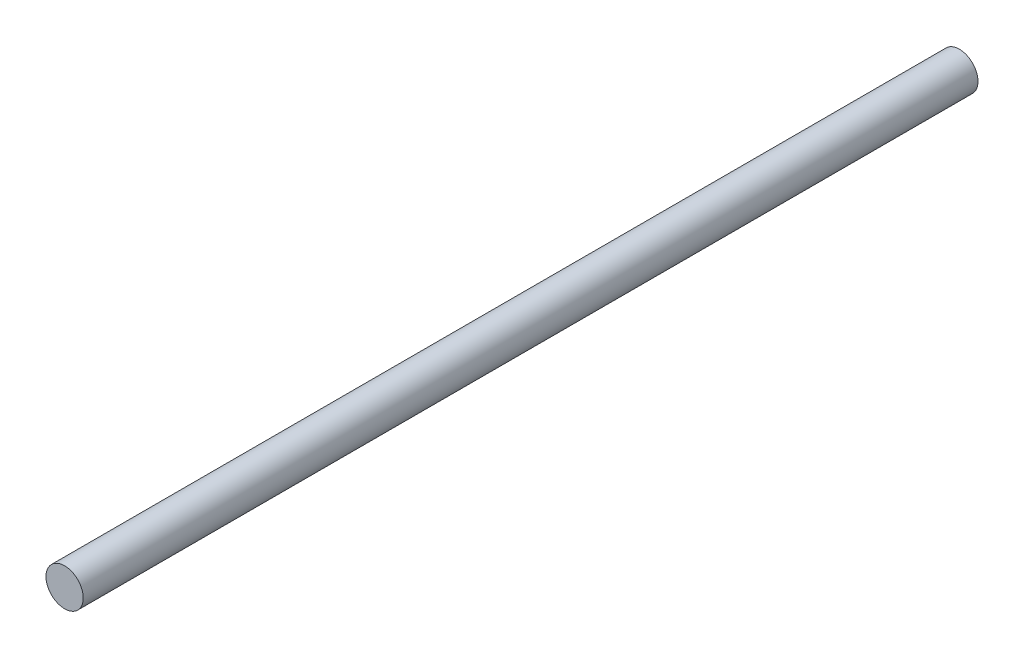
ISO-10303-21;
HEADER;
FILE_DESCRIPTION(('STEP AP214'),'2;1');
FILE_NAME('part.step','',(''),(''),'','','');
FILE_SCHEMA(('AUTOMOTIVE_DESIGN { 1 0 10303 214 1 1 1 1 }'));
ENDSEC;
DATA;
#1=APPLICATION_CONTEXT('core data for automotive mechanical design processes');
#2=APPLICATION_PROTOCOL_DEFINITION('international standard','automotive_design',2000,#1);
#3=PRODUCT_CONTEXT('',#1,'mechanical');
#4=PRODUCT('Part','Part','',(#3));
#5=PRODUCT_RELATED_PRODUCT_CATEGORY('part','',(#4));
#6=PRODUCT_DEFINITION_FORMATION('','',#4);
#7=PRODUCT_DEFINITION_CONTEXT('part definition',#1,'design');
#8=PRODUCT_DEFINITION('design','',#6,#7);
#9=PRODUCT_DEFINITION_SHAPE('','',#8);
#10=(LENGTH_UNIT() NAMED_UNIT(*) SI_UNIT(.MILLI.,.METRE.));
#11=(NAMED_UNIT(*) PLANE_ANGLE_UNIT() SI_UNIT($,.RADIAN.));
#12=(NAMED_UNIT(*) SI_UNIT($,.STERADIAN.) SOLID_ANGLE_UNIT());
#13=UNCERTAINTY_MEASURE_WITH_UNIT(LENGTH_MEASURE(1.E-05),#10,'distance_accuracy_value','');
#14=(GEOMETRIC_REPRESENTATION_CONTEXT(3) GLOBAL_UNCERTAINTY_ASSIGNED_CONTEXT((#13)) GLOBAL_UNIT_ASSIGNED_CONTEXT((#10,
#11,#12)) REPRESENTATION_CONTEXT('',''));
#15=CARTESIAN_POINT('',(0.,0.,0.));
#16=DIRECTION('',(0.,0.,1.));
#17=DIRECTION('',(1.,0.,0.));
#18=AXIS2_PLACEMENT_3D('',#15,#16,#17);
#19=CARTESIAN_POINT('',(0.,0.,480.));
#20=DIRECTION('',(0.,0.,-1.));
#21=DIRECTION('',(-1.,0.,0.));
#22=AXIS2_PLACEMENT_3D('',#19,#20,#21);
#23=CYLINDRICAL_SURFACE('',#22,10.);
#24=CARTESIAN_POINT('',(0.,0.,480.));
#25=DIRECTION('',(0.,0.,1.));
#26=DIRECTION('',(1.,0.,0.));
#27=AXIS2_PLACEMENT_3D('',#24,#25,#26);
#28=CIRCLE('',#27,10.);
#29=CARTESIAN_POINT('',(10.,0.,480.));
#30=VERTEX_POINT('',#29);
#31=EDGE_CURVE('E10',#30,#30,#28,.T.);
#32=ORIENTED_EDGE('',*,*,#31,.F.);
#33=EDGE_LOOP('',(#32));
#34=FACE_BOUND('',#33,.T.);
#35=CARTESIAN_POINT('',(0.,0.,0.));
#36=DIRECTION('',(0.,0.,1.));
#37=DIRECTION('',(1.,0.,0.));
#38=AXIS2_PLACEMENT_3D('',#35,#36,#37);
#39=CIRCLE('',#38,10.);
#40=CARTESIAN_POINT('',(10.,0.,0.));
#41=VERTEX_POINT('',#40);
#42=EDGE_CURVE('E36',#41,#41,#39,.T.);
#43=ORIENTED_EDGE('',*,*,#42,.T.);
#44=EDGE_LOOP('',(#43));
#45=FACE_BOUND('',#44,.T.);
#46=ADVANCED_FACE('F33',(#34,#45),#23,.T.);
#47=CARTESIAN_POINT('',(0.,0.,480.));
#48=DIRECTION('',(0.,0.,1.));
#49=DIRECTION('',(1.,0.,0.));
#50=AXIS2_PLACEMENT_3D('',#47,#48,#49);
#51=PLANE('',#50);
#52=ORIENTED_EDGE('',*,*,#31,.T.);
#53=EDGE_LOOP('',(#52));
#54=FACE_BOUND('',#53,.T.);
#55=ADVANCED_FACE('F48',(#54),#51,.T.);
#56=CARTESIAN_POINT('',(0.,0.,0.));
#57=DIRECTION('',(0.,0.,1.));
#58=DIRECTION('',(1.,0.,0.));
#59=AXIS2_PLACEMENT_3D('',#56,#57,#58);
#60=PLANE('',#59);
#61=ORIENTED_EDGE('',*,*,#42,.F.);
#62=EDGE_LOOP('',(#61));
#63=FACE_BOUND('',#62,.T.);
#64=ADVANCED_FACE('F46',(#63),#60,.F.);
#65=CLOSED_SHELL('',(#46,#55,#64));
#66=MANIFOLD_SOLID_BREP('B2',#65);
#67=ADVANCED_BREP_SHAPE_REPRESENTATION('',(#18,#66),#14);
#68=SHAPE_DEFINITION_REPRESENTATION(#9,#67);
ENDSEC;
END-ISO-10303-21;
